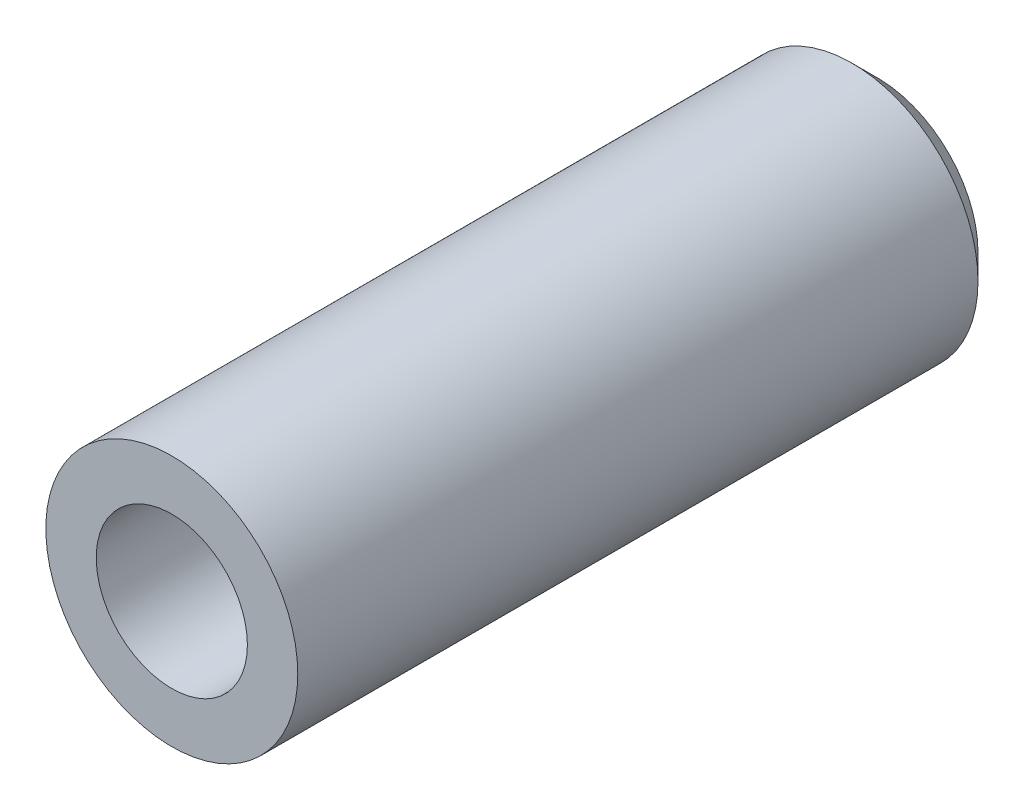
from build123d import *

# Parameters (mm, degrees)
ESQUISSE1_R             = 5
BOSS_EXTRU_1_DEPTH      = 28
ESQUISSE2_R             = 3
ENL_V_MAT_EXTRU_1_DEPTH = 13
ESQUISSE3_R             = 1
ENL_V_MAT_EXTRU_2_DEPTH = 308.835027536
CHANFREIN1_SIZE         = 1


with BuildPart() as part:
    # Esquisse1 → Boss.-Extru.1 (new body)
    with BuildSketch(Plane.XY):
        with Locations((38.379614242, 299.393845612)):
            Circle(ESQUISSE1_R)
    extrude(amount=BOSS_EXTRU_1_DEPTH)

    # Esquisse2 → Enl_v. mat.-Extru.1 (cut)
    with BuildSketch(Plane.XY.offset(28)):
        with Locations((38.379614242, 299.393845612)):
            Circle(ESQUISSE2_R)
    extrude(amount=-ENL_V_MAT_EXTRU_1_DEPTH, mode=Mode.SUBTRACT)

    # Esquisse3 → Enl_v. mat.-Extru.2 (cut, through all)
    with BuildSketch(Plane.XY.offset(15)):
        with Locations((38.379614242, 299.393845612)):
            Circle(ESQUISSE3_R)
    extrude(amount=-ENL_V_MAT_EXTRU_2_DEPTH, mode=Mode.SUBTRACT)

    # Chanfrein1
    chanfrein1_edges = [part.edges().sort_by_distance(p)[0] for p in [
        (33.379614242, 299.393845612, 0),
    ]]
    chamfer(chanfrein1_edges, length=CHANFREIN1_SIZE)


solid = part.part
